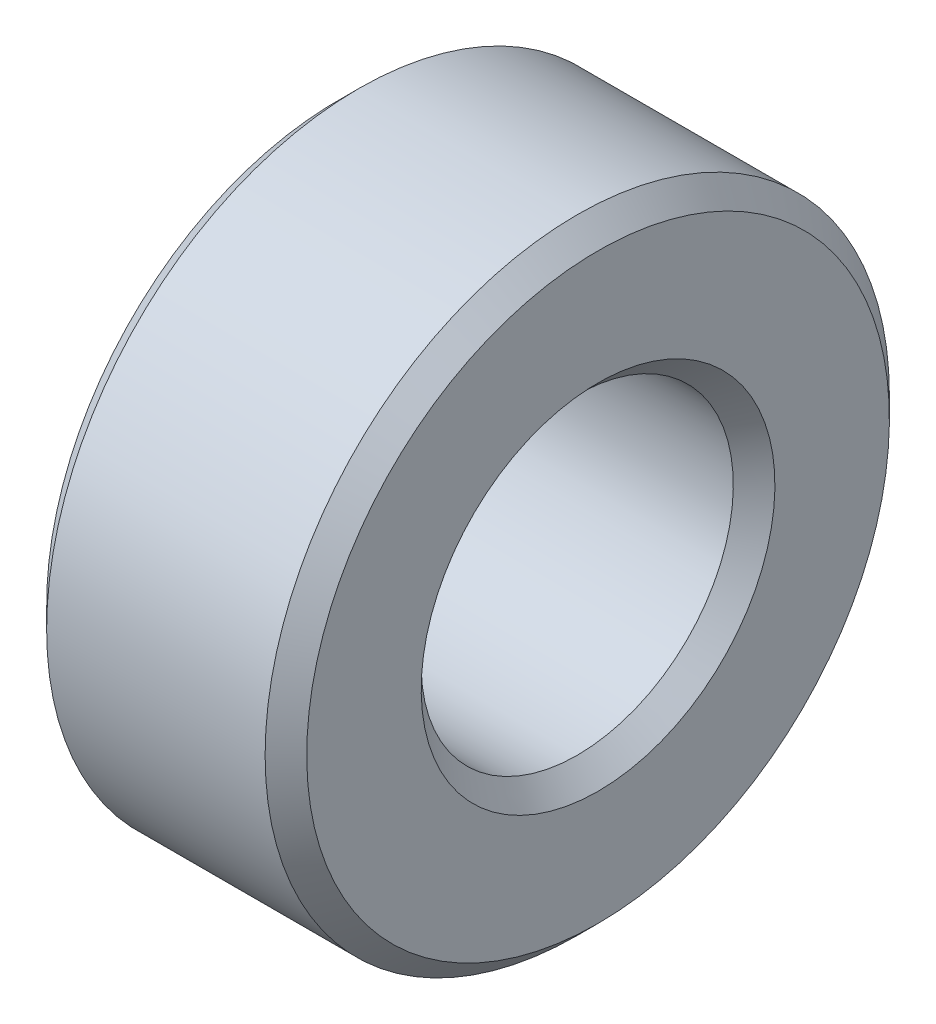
ISO-10303-21;
HEADER;
FILE_DESCRIPTION(('STEP AP214'),'2;1');
FILE_NAME('part.step','',(''),(''),'','','');
FILE_SCHEMA(('AUTOMOTIVE_DESIGN { 1 0 10303 214 1 1 1 1 }'));
ENDSEC;
DATA;
#1=APPLICATION_CONTEXT('core data for automotive mechanical design processes');
#2=APPLICATION_PROTOCOL_DEFINITION('international standard','automotive_design',2000,#1);
#3=PRODUCT_CONTEXT('',#1,'mechanical');
#4=PRODUCT('Part','Part','',(#3));
#5=PRODUCT_RELATED_PRODUCT_CATEGORY('part','',(#4));
#6=PRODUCT_DEFINITION_FORMATION('','',#4);
#7=PRODUCT_DEFINITION_CONTEXT('part definition',#1,'design');
#8=PRODUCT_DEFINITION('design','',#6,#7);
#9=PRODUCT_DEFINITION_SHAPE('','',#8);
#10=(LENGTH_UNIT() NAMED_UNIT(*) SI_UNIT(.MILLI.,.METRE.));
#11=(NAMED_UNIT(*) PLANE_ANGLE_UNIT() SI_UNIT($,.RADIAN.));
#12=(NAMED_UNIT(*) SI_UNIT($,.STERADIAN.) SOLID_ANGLE_UNIT());
#13=UNCERTAINTY_MEASURE_WITH_UNIT(LENGTH_MEASURE(1.E-05),#10,'distance_accuracy_value','');
#14=(GEOMETRIC_REPRESENTATION_CONTEXT(3) GLOBAL_UNCERTAINTY_ASSIGNED_CONTEXT((#13)) GLOBAL_UNIT_ASSIGNED_CONTEXT((#10,
#11,#12)) REPRESENTATION_CONTEXT('',''));
#15=CARTESIAN_POINT('',(0.,0.,0.));
#16=DIRECTION('',(0.,0.,1.));
#17=DIRECTION('',(1.,0.,0.));
#18=AXIS2_PLACEMENT_3D('',#15,#16,#17);
#19=CARTESIAN_POINT('',(0.,-4.5,0.));
#20=DIRECTION('',(-1.,0.,0.));
#21=DIRECTION('',(0.,1.,0.));
#22=AXIS2_PLACEMENT_3D('',#19,#20,#21);
#23=PLANE('',#22);
#24=CARTESIAN_POINT('',(0.,0.,0.));
#25=DIRECTION('',(1.,0.,0.));
#26=DIRECTION('',(0.,-1.,0.));
#27=AXIS2_PLACEMENT_3D('',#24,#25,#26);
#28=CIRCLE('',#27,3.4);
#29=CARTESIAN_POINT('',(0.,-3.4,0.));
#30=VERTEX_POINT('',#29);
#31=EDGE_CURVE('E10',#30,#30,#28,.T.);
#32=ORIENTED_EDGE('',*,*,#31,.T.);
#33=EDGE_LOOP('',(#32));
#34=FACE_BOUND('',#33,.T.);
#35=CARTESIAN_POINT('',(0.,0.,0.));
#36=DIRECTION('',(1.,0.,0.));
#37=DIRECTION('',(0.,-1.,0.));
#38=AXIS2_PLACEMENT_3D('',#35,#36,#37);
#39=CIRCLE('',#38,5.6);
#40=CARTESIAN_POINT('',(0.,-5.6,0.));
#41=VERTEX_POINT('',#40);
#42=EDGE_CURVE('E54',#41,#41,#39,.T.);
#43=ORIENTED_EDGE('',*,*,#42,.F.);
#44=EDGE_LOOP('',(#43));
#45=FACE_BOUND('',#44,.T.);
#46=ADVANCED_FACE('F16',(#34,#45),#23,.T.);
#47=CARTESIAN_POINT('',(0.2,0.,0.));
#48=DIRECTION('',(-1.,0.,0.));
#49=DIRECTION('',(0.,-1.,0.));
#50=AXIS2_PLACEMENT_3D('',#47,#48,#49);
#51=CONICAL_SURFACE('',#50,3.2,0.785398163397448);
#52=CARTESIAN_POINT('',(0.4,0.,0.));
#53=DIRECTION('',(1.,0.,0.));
#54=DIRECTION('',(0.,-1.,0.));
#55=AXIS2_PLACEMENT_3D('',#52,#53,#54);
#56=CIRCLE('',#55,3.);
#57=CARTESIAN_POINT('',(0.4,-3.,0.));
#58=VERTEX_POINT('',#57);
#59=EDGE_CURVE('E23',#58,#58,#56,.T.);
#60=ORIENTED_EDGE('',*,*,#59,.T.);
#61=EDGE_LOOP('',(#60));
#62=FACE_BOUND('',#61,.T.);
#63=ORIENTED_EDGE('',*,*,#31,.F.);
#64=EDGE_LOOP('',(#63));
#65=FACE_BOUND('',#64,.T.);
#66=ADVANCED_FACE('F87',(#62,#65),#51,.F.);
#67=CARTESIAN_POINT('',(2.5,0.,0.));
#68=DIRECTION('',(-1.,0.,0.));
#69=DIRECTION('',(0.,-1.,0.));
#70=AXIS2_PLACEMENT_3D('',#67,#68,#69);
#71=CYLINDRICAL_SURFACE('',#70,3.);
#72=CARTESIAN_POINT('',(4.6,0.,0.));
#73=DIRECTION('',(1.,0.,0.));
#74=DIRECTION('',(0.,-1.,0.));
#75=AXIS2_PLACEMENT_3D('',#72,#73,#74);
#76=CIRCLE('',#75,3.);
#77=CARTESIAN_POINT('',(4.6,-3.,0.));
#78=VERTEX_POINT('',#77);
#79=EDGE_CURVE('E64',#78,#78,#76,.T.);
#80=ORIENTED_EDGE('',*,*,#79,.T.);
#81=EDGE_LOOP('',(#80));
#82=FACE_BOUND('',#81,.T.);
#83=ORIENTED_EDGE('',*,*,#59,.F.);
#84=EDGE_LOOP('',(#83));
#85=FACE_BOUND('',#84,.T.);
#86=ADVANCED_FACE('F84',(#82,#85),#71,.F.);
#87=CARTESIAN_POINT('',(4.8,0.,0.));
#88=DIRECTION('',(1.,0.,0.));
#89=DIRECTION('',(0.,-1.,0.));
#90=AXIS2_PLACEMENT_3D('',#87,#88,#89);
#91=CONICAL_SURFACE('',#90,3.2,0.785398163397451);
#92=CARTESIAN_POINT('',(5.,0.,0.));
#93=DIRECTION('',(1.,0.,0.));
#94=DIRECTION('',(0.,-1.,0.));
#95=AXIS2_PLACEMENT_3D('',#92,#93,#94);
#96=CIRCLE('',#95,3.4);
#97=CARTESIAN_POINT('',(5.,-3.4,0.));
#98=VERTEX_POINT('',#97);
#99=EDGE_CURVE('E59',#98,#98,#96,.T.);
#100=ORIENTED_EDGE('',*,*,#99,.T.);
#101=EDGE_LOOP('',(#100));
#102=FACE_BOUND('',#101,.T.);
#103=ORIENTED_EDGE('',*,*,#79,.F.);
#104=EDGE_LOOP('',(#103));
#105=FACE_BOUND('',#104,.T.);
#106=ADVANCED_FACE('F69',(#102,#105),#91,.F.);
#107=CARTESIAN_POINT('',(5.,-4.5,0.));
#108=DIRECTION('',(1.,0.,0.));
#109=DIRECTION('',(0.,-1.,0.));
#110=AXIS2_PLACEMENT_3D('',#107,#108,#109);
#111=PLANE('',#110);
#112=CARTESIAN_POINT('',(5.,0.,0.));
#113=DIRECTION('',(1.,0.,0.));
#114=DIRECTION('',(0.,-1.,0.));
#115=AXIS2_PLACEMENT_3D('',#112,#113,#114);
#116=CIRCLE('',#115,5.6);
#117=CARTESIAN_POINT('',(5.,-5.6,0.));
#118=VERTEX_POINT('',#117);
#119=EDGE_CURVE('E62',#118,#118,#116,.T.);
#120=ORIENTED_EDGE('',*,*,#119,.T.);
#121=EDGE_LOOP('',(#120));
#122=FACE_BOUND('',#121,.T.);
#123=ORIENTED_EDGE('',*,*,#99,.F.);
#124=EDGE_LOOP('',(#123));
#125=FACE_BOUND('',#124,.T.);
#126=ADVANCED_FACE('F72',(#122,#125),#111,.T.);
#127=CARTESIAN_POINT('',(4.8,0.,0.));
#128=DIRECTION('',(-1.,0.,0.));
#129=DIRECTION('',(0.,-1.,0.));
#130=AXIS2_PLACEMENT_3D('',#127,#128,#129);
#131=CONICAL_SURFACE('',#130,5.8,0.785398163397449);
#132=CARTESIAN_POINT('',(4.6,0.,0.));
#133=DIRECTION('',(1.,0.,0.));
#134=DIRECTION('',(0.,-1.,0.));
#135=AXIS2_PLACEMENT_3D('',#132,#133,#134);
#136=CIRCLE('',#135,6.);
#137=CARTESIAN_POINT('',(4.6,-6.,0.));
#138=VERTEX_POINT('',#137);
#139=EDGE_CURVE('E56',#138,#138,#136,.T.);
#140=ORIENTED_EDGE('',*,*,#139,.T.);
#141=EDGE_LOOP('',(#140));
#142=FACE_BOUND('',#141,.T.);
#143=ORIENTED_EDGE('',*,*,#119,.F.);
#144=EDGE_LOOP('',(#143));
#145=FACE_BOUND('',#144,.T.);
#146=ADVANCED_FACE('F74',(#142,#145),#131,.T.);
#147=CARTESIAN_POINT('',(2.5,0.,0.));
#148=DIRECTION('',(-1.,0.,0.));
#149=DIRECTION('',(0.,-1.,0.));
#150=AXIS2_PLACEMENT_3D('',#147,#148,#149);
#151=CYLINDRICAL_SURFACE('',#150,6.);
#152=CARTESIAN_POINT('',(0.4,0.,0.));
#153=DIRECTION('',(1.,0.,0.));
#154=DIRECTION('',(0.,-1.,0.));
#155=AXIS2_PLACEMENT_3D('',#152,#153,#154);
#156=CIRCLE('',#155,6.);
#157=CARTESIAN_POINT('',(0.4,-6.,0.));
#158=VERTEX_POINT('',#157);
#159=EDGE_CURVE('E50',#158,#158,#156,.T.);
#160=ORIENTED_EDGE('',*,*,#159,.T.);
#161=EDGE_LOOP('',(#160));
#162=FACE_BOUND('',#161,.T.);
#163=ORIENTED_EDGE('',*,*,#139,.F.);
#164=EDGE_LOOP('',(#163));
#165=FACE_BOUND('',#164,.T.);
#166=ADVANCED_FACE('F51',(#162,#165),#151,.T.);
#167=CARTESIAN_POINT('',(0.2,0.,0.));
#168=DIRECTION('',(1.,0.,0.));
#169=DIRECTION('',(0.,-1.,0.));
#170=AXIS2_PLACEMENT_3D('',#167,#168,#169);
#171=CONICAL_SURFACE('',#170,5.8,0.785398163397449);
#172=ORIENTED_EDGE('',*,*,#42,.T.);
#173=EDGE_LOOP('',(#172));
#174=FACE_BOUND('',#173,.T.);
#175=ORIENTED_EDGE('',*,*,#159,.F.);
#176=EDGE_LOOP('',(#175));
#177=FACE_BOUND('',#176,.T.);
#178=ADVANCED_FACE('F94',(#174,#177),#171,.T.);
#179=CLOSED_SHELL('',(#46,#66,#86,#106,#126,#146,#166,#178));
#180=MANIFOLD_SOLID_BREP('B1',#179);
#181=ADVANCED_BREP_SHAPE_REPRESENTATION('',(#18,#180),#14);
#182=SHAPE_DEFINITION_REPRESENTATION(#9,#181);
ENDSEC;
END-ISO-10303-21;
